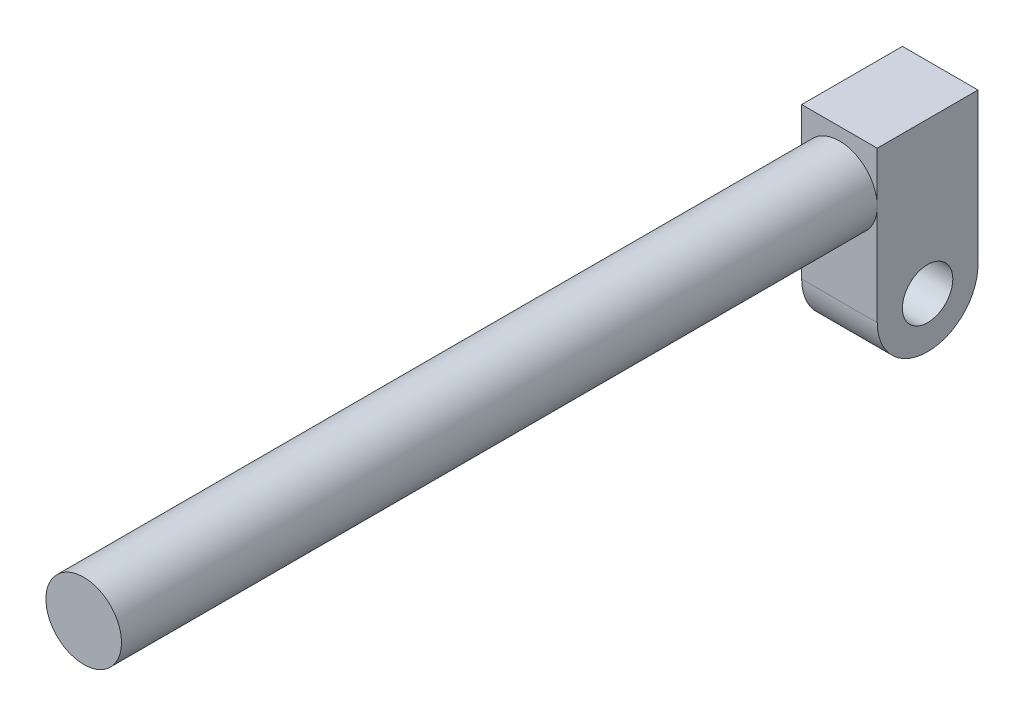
from build123d import *

# Parameters (mm, degrees)
SKETCH1_R           = 40
SKETCH1_R_2         = 20
BOSS_EXTRUDE1_DEPTH = 30
SKETCH2_R           = 30
BOSS_EXTRUDE3_DEPTH = 600


with BuildPart() as part:
    # Sketch1 → Boss-Extrude1 (new, symmetric)
    # profile 1 of 2: a face of its own
    with BuildSketch(Plane(origin=(0, 0, 0), x_dir=(0, 0, -1), z_dir=(1, 0, 0))):
        with BuildLine():
            Line((-40, 120), (-40, 0))
            ThreePointArc((-40, 0), (0, 40), (40, 0))
            Line((40, 0), (40, 120))
            Line((40, 120), (-40, 120))
        make_face()
    # profile 2 of 2: a face of its own
    with BuildSketch(Plane(origin=(0, 0, 0), x_dir=(0, 0, -1), z_dir=(1, 0, 0))):
        Circle(SKETCH1_R)
        Circle(SKETCH1_R_2, mode=Mode.SUBTRACT)
    extrude(amount=BOSS_EXTRUDE1_DEPTH, both=True)

    # Sketch2 → Boss-Extrude3 (add)
    with BuildSketch(Plane.XY.offset(40)):
        with Locations((0, 80)):
            Circle(SKETCH2_R)
    extrude(amount=BOSS_EXTRUDE3_DEPTH)


solid = part.part
